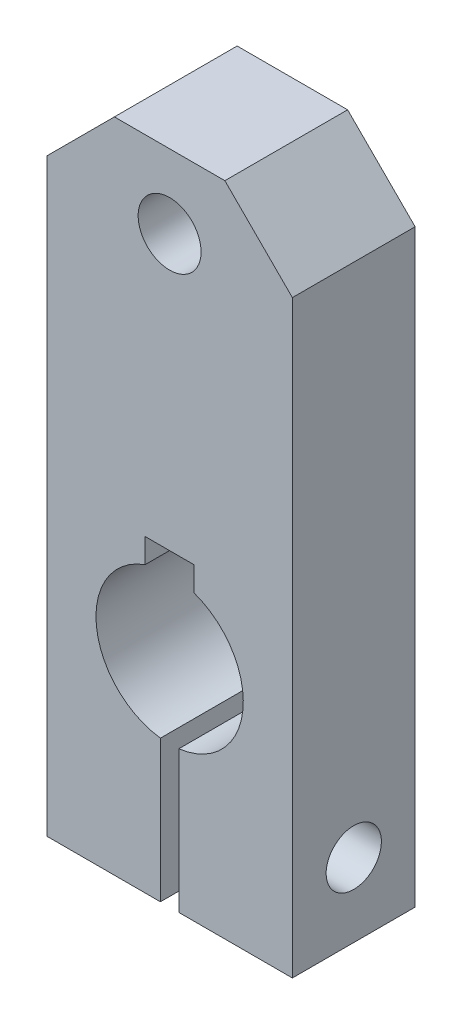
ISO-10303-21;
HEADER;
FILE_DESCRIPTION(('STEP AP214'),'2;1');
FILE_NAME('part.step','',(''),(''),'','','');
FILE_SCHEMA(('AUTOMOTIVE_DESIGN { 1 0 10303 214 1 1 1 1 }'));
ENDSEC;
DATA;
#1=APPLICATION_CONTEXT('core data for automotive mechanical design processes');
#2=APPLICATION_PROTOCOL_DEFINITION('international standard','automotive_design',2000,#1);
#3=PRODUCT_CONTEXT('',#1,'mechanical');
#4=PRODUCT('Part','Part','',(#3));
#5=PRODUCT_RELATED_PRODUCT_CATEGORY('part','',(#4));
#6=PRODUCT_DEFINITION_FORMATION('','',#4);
#7=PRODUCT_DEFINITION_CONTEXT('part definition',#1,'design');
#8=PRODUCT_DEFINITION('design','',#6,#7);
#9=PRODUCT_DEFINITION_SHAPE('','',#8);
#10=(LENGTH_UNIT() NAMED_UNIT(*) SI_UNIT(.MILLI.,.METRE.));
#11=(NAMED_UNIT(*) PLANE_ANGLE_UNIT() SI_UNIT($,.RADIAN.));
#12=(NAMED_UNIT(*) SI_UNIT($,.STERADIAN.) SOLID_ANGLE_UNIT());
#13=UNCERTAINTY_MEASURE_WITH_UNIT(LENGTH_MEASURE(1.E-05),#10,'distance_accuracy_value','');
#14=(GEOMETRIC_REPRESENTATION_CONTEXT(3) GLOBAL_UNCERTAINTY_ASSIGNED_CONTEXT((#13)) GLOBAL_UNIT_ASSIGNED_CONTEXT((#10,
#11,#12)) REPRESENTATION_CONTEXT('',''));
#15=CARTESIAN_POINT('',(0.,0.,0.));
#16=DIRECTION('',(0.,0.,1.));
#17=DIRECTION('',(1.,0.,0.));
#18=AXIS2_PLACEMENT_3D('',#15,#16,#17);
#19=CARTESIAN_POINT('',(0.,35.,10.));
#20=DIRECTION('',(0.,0.,1.));
#21=DIRECTION('',(1.,0.,0.));
#22=AXIS2_PLACEMENT_3D('',#19,#20,#21);
#23=PLANE('',#22);
#24=DIRECTION('',(1.,0.,0.));
#25=VECTOR('',#24,1.);
#26=CARTESIAN_POINT('',(1.5,0.,10.));
#27=LINE('',#26,#25);
#28=CARTESIAN_POINT('',(1.5,0.,10.));
#29=VERTEX_POINT('',#28);
#30=CARTESIAN_POINT('',(20.,0.,10.));
#31=VERTEX_POINT('',#30);
#32=EDGE_CURVE('E185',#29,#31,#27,.T.);
#33=ORIENTED_EDGE('',*,*,#32,.T.);
#34=DIRECTION('',(0.,1.,0.));
#35=VECTOR('',#34,1.);
#36=CARTESIAN_POINT('',(20.,96.,10.));
#37=LINE('',#36,#35);
#38=CARTESIAN_POINT('',(20.,96.,10.));
#39=VERTEX_POINT('',#38);
#40=EDGE_CURVE('E150',#31,#39,#37,.T.);
#41=ORIENTED_EDGE('',*,*,#40,.T.);
#42=DIRECTION('',(-0.707106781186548,0.707106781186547,0.));
#43=VECTOR('',#42,1.);
#44=CARTESIAN_POINT('',(8.99999999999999,107.,10.));
#45=LINE('',#44,#43);
#46=CARTESIAN_POINT('',(8.99999999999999,107.,10.));
#47=VERTEX_POINT('',#46);
#48=EDGE_CURVE('E188',#39,#47,#45,.T.);
#49=ORIENTED_EDGE('',*,*,#48,.T.);
#50=DIRECTION('',(-1.,0.,0.));
#51=VECTOR('',#50,1.);
#52=CARTESIAN_POINT('',(-9.00000000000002,107.,10.));
#53=LINE('',#52,#51);
#54=CARTESIAN_POINT('',(-9.00000000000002,107.,10.));
#55=VERTEX_POINT('',#54);
#56=EDGE_CURVE('E190',#47,#55,#53,.T.);
#57=ORIENTED_EDGE('',*,*,#56,.T.);
#58=DIRECTION('',(-0.707106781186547,-0.707106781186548,0.));
#59=VECTOR('',#58,1.);
#60=CARTESIAN_POINT('',(-20.,96.,10.));
#61=LINE('',#60,#59);
#62=CARTESIAN_POINT('',(-20.,96.,10.));
#63=VERTEX_POINT('',#62);
#64=EDGE_CURVE('E192',#55,#63,#61,.T.);
#65=ORIENTED_EDGE('',*,*,#64,.T.);
#66=DIRECTION('',(0.,-1.,0.));
#67=VECTOR('',#66,1.);
#68=CARTESIAN_POINT('',(-20.,96.,10.));
#69=LINE('',#68,#67);
#70=CARTESIAN_POINT('',(-20.,0.,10.));
#71=VERTEX_POINT('',#70);
#72=EDGE_CURVE('E194',#63,#71,#69,.T.);
#73=ORIENTED_EDGE('',*,*,#72,.T.);
#74=DIRECTION('',(1.,0.,0.));
#75=VECTOR('',#74,1.);
#76=CARTESIAN_POINT('',(-20.,0.,10.));
#77=LINE('',#76,#75);
#78=CARTESIAN_POINT('',(-1.5,0.,10.));
#79=VERTEX_POINT('',#78);
#80=EDGE_CURVE('E196',#71,#79,#77,.T.);
#81=ORIENTED_EDGE('',*,*,#80,.T.);
#82=DIRECTION('',(0.,1.,0.));
#83=VECTOR('',#82,1.);
#84=CARTESIAN_POINT('',(-1.5,23.0941191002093,10.));
#85=LINE('',#84,#83);
#86=CARTESIAN_POINT('',(-1.5,23.0941191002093,10.));
#87=VERTEX_POINT('',#86);
#88=EDGE_CURVE('E198',#79,#87,#85,.T.);
#89=ORIENTED_EDGE('',*,*,#88,.T.);
#90=CARTESIAN_POINT('',(0.,35.,10.));
#91=DIRECTION('',(0.,0.,-1.));
#92=DIRECTION('',(1.,0.,0.));
#93=AXIS2_PLACEMENT_3D('',#90,#91,#92);
#94=CIRCLE('',#93,12.);
#95=CARTESIAN_POINT('',(-4.,46.3137084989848,10.));
#96=VERTEX_POINT('',#95);
#97=EDGE_CURVE('E200',#87,#96,#94,.T.);
#98=ORIENTED_EDGE('',*,*,#97,.T.);
#99=DIRECTION('',(0.,1.,0.));
#100=VECTOR('',#99,1.);
#101=CARTESIAN_POINT('',(-4.,50.3,10.));
#102=LINE('',#101,#100);
#103=CARTESIAN_POINT('',(-4.,50.3,10.));
#104=VERTEX_POINT('',#103);
#105=EDGE_CURVE('E202',#96,#104,#102,.T.);
#106=ORIENTED_EDGE('',*,*,#105,.T.);
#107=DIRECTION('',(1.,0.,0.));
#108=VECTOR('',#107,1.);
#109=CARTESIAN_POINT('',(-4.,50.3,10.));
#110=LINE('',#109,#108);
#111=CARTESIAN_POINT('',(4.,50.3,10.));
#112=VERTEX_POINT('',#111);
#113=EDGE_CURVE('E204',#104,#112,#110,.T.);
#114=ORIENTED_EDGE('',*,*,#113,.T.);
#115=DIRECTION('',(0.,-1.,0.));
#116=VECTOR('',#115,1.);
#117=CARTESIAN_POINT('',(4.,50.3,10.));
#118=LINE('',#117,#116);
#119=CARTESIAN_POINT('',(4.,46.3137084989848,10.));
#120=VERTEX_POINT('',#119);
#121=EDGE_CURVE('E206',#112,#120,#118,.T.);
#122=ORIENTED_EDGE('',*,*,#121,.T.);
#123=CARTESIAN_POINT('',(0.,35.,10.));
#124=DIRECTION('',(0.,0.,-1.));
#125=DIRECTION('',(1.,0.,0.));
#126=AXIS2_PLACEMENT_3D('',#123,#124,#125);
#127=CIRCLE('',#126,12.);
#128=CARTESIAN_POINT('',(1.5,23.0941191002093,10.));
#129=VERTEX_POINT('',#128);
#130=EDGE_CURVE('E54',#120,#129,#127,.T.);
#131=ORIENTED_EDGE('',*,*,#130,.T.);
#132=DIRECTION('',(0.,-1.,0.));
#133=VECTOR('',#132,1.);
#134=CARTESIAN_POINT('',(1.5,23.0941191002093,10.));
#135=LINE('',#134,#133);
#136=EDGE_CURVE('E49',#129,#29,#135,.T.);
#137=ORIENTED_EDGE('',*,*,#136,.T.);
#138=EDGE_LOOP('',(#33,#41,#49,#57,#65,#73,#81,#89,#98,#106,#114,#122,#131,#137));
#139=FACE_BOUND('',#138,.T.);
#140=CARTESIAN_POINT('',(0.,95.,10.));
#141=DIRECTION('',(0.,0.,1.));
#142=DIRECTION('',(1.,0.,0.));
#143=AXIS2_PLACEMENT_3D('',#140,#141,#142);
#144=CIRCLE('',#143,5.125);
#145=CARTESIAN_POINT('',(5.125,95.,10.));
#146=VERTEX_POINT('',#145);
#147=EDGE_CURVE('E155',#146,#146,#144,.T.);
#148=ORIENTED_EDGE('',*,*,#147,.F.);
#149=EDGE_LOOP('',(#148));
#150=FACE_BOUND('',#149,.T.);
#151=ADVANCED_FACE('F34',(#139,#150),#23,.T.);
#152=CARTESIAN_POINT('',(0.,35.,-10.));
#153=DIRECTION('',(0.,0.,1.));
#154=DIRECTION('',(1.,0.,0.));
#155=AXIS2_PLACEMENT_3D('',#152,#153,#154);
#156=PLANE('',#155);
#157=DIRECTION('',(1.,0.,0.));
#158=VECTOR('',#157,1.);
#159=CARTESIAN_POINT('',(1.5,0.,-10.));
#160=LINE('',#159,#158);
#161=CARTESIAN_POINT('',(1.5,0.,-10.));
#162=VERTEX_POINT('',#161);
#163=CARTESIAN_POINT('',(20.,0.,-10.));
#164=VERTEX_POINT('',#163);
#165=EDGE_CURVE('E141',#162,#164,#160,.T.);
#166=ORIENTED_EDGE('',*,*,#165,.F.);
#167=DIRECTION('',(0.,-1.,0.));
#168=VECTOR('',#167,1.);
#169=CARTESIAN_POINT('',(1.5,23.0941191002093,-10.));
#170=LINE('',#169,#168);
#171=CARTESIAN_POINT('',(1.5,23.0941191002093,-10.));
#172=VERTEX_POINT('',#171);
#173=EDGE_CURVE('E183',#172,#162,#170,.T.);
#174=ORIENTED_EDGE('',*,*,#173,.F.);
#175=CARTESIAN_POINT('',(0.,35.,-10.));
#176=DIRECTION('',(0.,0.,-1.));
#177=DIRECTION('',(1.,0.,0.));
#178=AXIS2_PLACEMENT_3D('',#175,#176,#177);
#179=CIRCLE('',#178,12.);
#180=CARTESIAN_POINT('',(4.,46.3137084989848,-10.));
#181=VERTEX_POINT('',#180);
#182=EDGE_CURVE('E181',#181,#172,#179,.T.);
#183=ORIENTED_EDGE('',*,*,#182,.F.);
#184=DIRECTION('',(0.,-1.,0.));
#185=VECTOR('',#184,1.);
#186=CARTESIAN_POINT('',(4.,50.3,-10.));
#187=LINE('',#186,#185);
#188=CARTESIAN_POINT('',(4.,50.3,-10.));
#189=VERTEX_POINT('',#188);
#190=EDGE_CURVE('E179',#189,#181,#187,.T.);
#191=ORIENTED_EDGE('',*,*,#190,.F.);
#192=DIRECTION('',(1.,0.,0.));
#193=VECTOR('',#192,1.);
#194=CARTESIAN_POINT('',(-4.,50.3,-10.));
#195=LINE('',#194,#193);
#196=CARTESIAN_POINT('',(-4.,50.3,-10.));
#197=VERTEX_POINT('',#196);
#198=EDGE_CURVE('E177',#197,#189,#195,.T.);
#199=ORIENTED_EDGE('',*,*,#198,.F.);
#200=DIRECTION('',(0.,1.,0.));
#201=VECTOR('',#200,1.);
#202=CARTESIAN_POINT('',(-4.,50.3,-10.));
#203=LINE('',#202,#201);
#204=CARTESIAN_POINT('',(-4.,46.3137084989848,-10.));
#205=VERTEX_POINT('',#204);
#206=EDGE_CURVE('E175',#205,#197,#203,.T.);
#207=ORIENTED_EDGE('',*,*,#206,.F.);
#208=CARTESIAN_POINT('',(0.,35.,-10.));
#209=DIRECTION('',(0.,0.,-1.));
#210=DIRECTION('',(1.,0.,0.));
#211=AXIS2_PLACEMENT_3D('',#208,#209,#210);
#212=CIRCLE('',#211,12.);
#213=CARTESIAN_POINT('',(-1.5,23.0941191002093,-10.));
#214=VERTEX_POINT('',#213);
#215=EDGE_CURVE('E173',#214,#205,#212,.T.);
#216=ORIENTED_EDGE('',*,*,#215,.F.);
#217=DIRECTION('',(0.,1.,0.));
#218=VECTOR('',#217,1.);
#219=CARTESIAN_POINT('',(-1.5,23.0941191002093,-10.));
#220=LINE('',#219,#218);
#221=CARTESIAN_POINT('',(-1.5,0.,-10.));
#222=VERTEX_POINT('',#221);
#223=EDGE_CURVE('E171',#222,#214,#220,.T.);
#224=ORIENTED_EDGE('',*,*,#223,.F.);
#225=DIRECTION('',(1.,0.,0.));
#226=VECTOR('',#225,1.);
#227=CARTESIAN_POINT('',(-20.,0.,-10.));
#228=LINE('',#227,#226);
#229=CARTESIAN_POINT('',(-20.,0.,-10.));
#230=VERTEX_POINT('',#229);
#231=EDGE_CURVE('E169',#230,#222,#228,.T.);
#232=ORIENTED_EDGE('',*,*,#231,.F.);
#233=DIRECTION('',(0.,-1.,0.));
#234=VECTOR('',#233,1.);
#235=CARTESIAN_POINT('',(-20.,96.,-10.));
#236=LINE('',#235,#234);
#237=CARTESIAN_POINT('',(-20.,96.,-10.));
#238=VERTEX_POINT('',#237);
#239=EDGE_CURVE('E167',#238,#230,#236,.T.);
#240=ORIENTED_EDGE('',*,*,#239,.F.);
#241=DIRECTION('',(-0.707106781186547,-0.707106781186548,0.));
#242=VECTOR('',#241,1.);
#243=CARTESIAN_POINT('',(-20.,96.,-10.));
#244=LINE('',#243,#242);
#245=CARTESIAN_POINT('',(-9.00000000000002,107.,-10.));
#246=VERTEX_POINT('',#245);
#247=EDGE_CURVE('E165',#246,#238,#244,.T.);
#248=ORIENTED_EDGE('',*,*,#247,.F.);
#249=DIRECTION('',(-1.,0.,0.));
#250=VECTOR('',#249,1.);
#251=CARTESIAN_POINT('',(-9.00000000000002,107.,-10.));
#252=LINE('',#251,#250);
#253=CARTESIAN_POINT('',(8.99999999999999,107.,-10.));
#254=VERTEX_POINT('',#253);
#255=EDGE_CURVE('E163',#254,#246,#252,.T.);
#256=ORIENTED_EDGE('',*,*,#255,.F.);
#257=DIRECTION('',(-0.707106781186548,0.707106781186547,0.));
#258=VECTOR('',#257,1.);
#259=CARTESIAN_POINT('',(8.99999999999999,107.,-10.));
#260=LINE('',#259,#258);
#261=CARTESIAN_POINT('',(20.,96.,-10.));
#262=VERTEX_POINT('',#261);
#263=EDGE_CURVE('E143',#262,#254,#260,.T.);
#264=ORIENTED_EDGE('',*,*,#263,.F.);
#265=DIRECTION('',(0.,1.,0.));
#266=VECTOR('',#265,1.);
#267=CARTESIAN_POINT('',(20.,96.,-10.));
#268=LINE('',#267,#266);
#269=EDGE_CURVE('E136',#164,#262,#268,.T.);
#270=ORIENTED_EDGE('',*,*,#269,.F.);
#271=EDGE_LOOP('',(#166,#174,#183,#191,#199,#207,#216,#224,#232,#240,#248,#256,#264,#270));
#272=FACE_BOUND('',#271,.T.);
#273=CARTESIAN_POINT('',(0.,95.,-10.));
#274=DIRECTION('',(0.,0.,1.));
#275=DIRECTION('',(1.,0.,0.));
#276=AXIS2_PLACEMENT_3D('',#273,#274,#275);
#277=CIRCLE('',#276,5.125);
#278=CARTESIAN_POINT('',(5.125,95.,-10.));
#279=VERTEX_POINT('',#278);
#280=EDGE_CURVE('E158',#279,#279,#277,.T.);
#281=ORIENTED_EDGE('',*,*,#280,.T.);
#282=EDGE_LOOP('',(#281));
#283=FACE_BOUND('',#282,.T.);
#284=ADVANCED_FACE('F137',(#272,#283),#156,.F.);
#285=CARTESIAN_POINT('',(1.5,0.,10.));
#286=DIRECTION('',(0.,1.,0.));
#287=DIRECTION('',(0.,0.,1.));
#288=AXIS2_PLACEMENT_3D('',#285,#286,#287);
#289=PLANE('',#288);
#290=ORIENTED_EDGE('',*,*,#165,.T.);
#291=DIRECTION('',(0.,0.,-1.));
#292=VECTOR('',#291,1.);
#293=CARTESIAN_POINT('',(20.,0.,10.));
#294=LINE('',#293,#292);
#295=EDGE_CURVE('E11',#31,#164,#294,.T.);
#296=ORIENTED_EDGE('',*,*,#295,.F.);
#297=ORIENTED_EDGE('',*,*,#32,.F.);
#298=DIRECTION('',(0.,0.,-1.));
#299=VECTOR('',#298,1.);
#300=CARTESIAN_POINT('',(1.5,0.,10.));
#301=LINE('',#300,#299);
#302=EDGE_CURVE('E154',#29,#162,#301,.T.);
#303=ORIENTED_EDGE('',*,*,#302,.T.);
#304=EDGE_LOOP('',(#290,#296,#297,#303));
#305=FACE_BOUND('',#304,.T.);
#306=ADVANCED_FACE('F36',(#305),#289,.F.);
#307=CARTESIAN_POINT('',(20.,96.,10.));
#308=DIRECTION('',(-1.,0.,0.));
#309=DIRECTION('',(0.,-1.,0.));
#310=AXIS2_PLACEMENT_3D('',#307,#308,#309);
#311=PLANE('',#310);
#312=CARTESIAN_POINT('',(20.,12.,0.));
#313=DIRECTION('',(1.,0.,0.));
#314=DIRECTION('',(0.,1.,0.));
#315=AXIS2_PLACEMENT_3D('',#312,#313,#314);
#316=CIRCLE('',#315,4.5);
#317=CARTESIAN_POINT('',(20.,16.5,0.));
#318=VERTEX_POINT('',#317);
#319=EDGE_CURVE('E339',#318,#318,#316,.T.);
#320=ORIENTED_EDGE('',*,*,#319,.F.);
#321=EDGE_LOOP('',(#320));
#322=FACE_BOUND('',#321,.T.);
#323=ORIENTED_EDGE('',*,*,#269,.T.);
#324=DIRECTION('',(0.,0.,-1.));
#325=VECTOR('',#324,1.);
#326=CARTESIAN_POINT('',(20.,96.,10.));
#327=LINE('',#326,#325);
#328=EDGE_CURVE('E42',#39,#262,#327,.T.);
#329=ORIENTED_EDGE('',*,*,#328,.F.);
#330=ORIENTED_EDGE('',*,*,#40,.F.);
#331=ORIENTED_EDGE('',*,*,#295,.T.);
#332=EDGE_LOOP('',(#323,#329,#330,#331));
#333=FACE_BOUND('',#332,.T.);
#334=ADVANCED_FACE('F149',(#322,#333),#311,.F.);
#335=CARTESIAN_POINT('',(8.99999999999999,107.,10.));
#336=DIRECTION('',(-0.707106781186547,-0.707106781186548,0.));
#337=DIRECTION('',(0.707106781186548,-0.707106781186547,0.));
#338=AXIS2_PLACEMENT_3D('',#335,#336,#337);
#339=PLANE('',#338);
#340=ORIENTED_EDGE('',*,*,#263,.T.);
#341=DIRECTION('',(0.,0.,-1.));
#342=VECTOR('',#341,1.);
#343=CARTESIAN_POINT('',(8.99999999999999,107.,10.));
#344=LINE('',#343,#342);
#345=EDGE_CURVE('E241',#47,#254,#344,.T.);
#346=ORIENTED_EDGE('',*,*,#345,.F.);
#347=ORIENTED_EDGE('',*,*,#48,.F.);
#348=ORIENTED_EDGE('',*,*,#328,.T.);
#349=EDGE_LOOP('',(#340,#346,#347,#348));
#350=FACE_BOUND('',#349,.T.);
#351=ADVANCED_FACE('F245',(#350),#339,.F.);
#352=CARTESIAN_POINT('',(-9.00000000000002,107.,10.));
#353=DIRECTION('',(0.,-1.,0.));
#354=DIRECTION('',(1.,0.,0.));
#355=AXIS2_PLACEMENT_3D('',#352,#353,#354);
#356=PLANE('',#355);
#357=ORIENTED_EDGE('',*,*,#255,.T.);
#358=DIRECTION('',(0.,0.,-1.));
#359=VECTOR('',#358,1.);
#360=CARTESIAN_POINT('',(-9.00000000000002,107.,10.));
#361=LINE('',#360,#359);
#362=EDGE_CURVE('E238',#55,#246,#361,.T.);
#363=ORIENTED_EDGE('',*,*,#362,.F.);
#364=ORIENTED_EDGE('',*,*,#56,.F.);
#365=ORIENTED_EDGE('',*,*,#345,.T.);
#366=EDGE_LOOP('',(#357,#363,#364,#365));
#367=FACE_BOUND('',#366,.T.);
#368=ADVANCED_FACE('F253',(#367),#356,.F.);
#369=CARTESIAN_POINT('',(-20.,96.,10.));
#370=DIRECTION('',(0.707106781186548,-0.707106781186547,0.));
#371=DIRECTION('',(0.707106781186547,0.707106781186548,0.));
#372=AXIS2_PLACEMENT_3D('',#369,#370,#371);
#373=PLANE('',#372);
#374=ORIENTED_EDGE('',*,*,#247,.T.);
#375=DIRECTION('',(0.,0.,-1.));
#376=VECTOR('',#375,1.);
#377=CARTESIAN_POINT('',(-20.,96.,10.));
#378=LINE('',#377,#376);
#379=EDGE_CURVE('E235',#63,#238,#378,.T.);
#380=ORIENTED_EDGE('',*,*,#379,.F.);
#381=ORIENTED_EDGE('',*,*,#64,.F.);
#382=ORIENTED_EDGE('',*,*,#362,.T.);
#383=EDGE_LOOP('',(#374,#380,#381,#382));
#384=FACE_BOUND('',#383,.T.);
#385=ADVANCED_FACE('F256',(#384),#373,.F.);
#386=CARTESIAN_POINT('',(-20.,96.,10.));
#387=DIRECTION('',(1.,0.,0.));
#388=DIRECTION('',(0.,1.,0.));
#389=AXIS2_PLACEMENT_3D('',#386,#387,#388);
#390=PLANE('',#389);
#391=CARTESIAN_POINT('',(-20.,12.,0.));
#392=DIRECTION('',(1.,0.,0.));
#393=DIRECTION('',(0.,1.,0.));
#394=AXIS2_PLACEMENT_3D('',#391,#392,#393);
#395=CIRCLE('',#394,3.375);
#396=CARTESIAN_POINT('',(-20.,15.375,0.));
#397=VERTEX_POINT('',#396);
#398=EDGE_CURVE('E328',#397,#397,#395,.T.);
#399=ORIENTED_EDGE('',*,*,#398,.T.);
#400=EDGE_LOOP('',(#399));
#401=FACE_BOUND('',#400,.T.);
#402=ORIENTED_EDGE('',*,*,#239,.T.);
#403=DIRECTION('',(0.,0.,-1.));
#404=VECTOR('',#403,1.);
#405=CARTESIAN_POINT('',(-20.,0.,10.));
#406=LINE('',#405,#404);
#407=EDGE_CURVE('E232',#71,#230,#406,.T.);
#408=ORIENTED_EDGE('',*,*,#407,.F.);
#409=ORIENTED_EDGE('',*,*,#72,.F.);
#410=ORIENTED_EDGE('',*,*,#379,.T.);
#411=EDGE_LOOP('',(#402,#408,#409,#410));
#412=FACE_BOUND('',#411,.T.);
#413=ADVANCED_FACE('F261',(#401,#412),#390,.F.);
#414=CARTESIAN_POINT('',(-20.,0.,10.));
#415=DIRECTION('',(0.,1.,0.));
#416=DIRECTION('',(0.,0.,1.));
#417=AXIS2_PLACEMENT_3D('',#414,#415,#416);
#418=PLANE('',#417);
#419=ORIENTED_EDGE('',*,*,#231,.T.);
#420=DIRECTION('',(0.,0.,-1.));
#421=VECTOR('',#420,1.);
#422=CARTESIAN_POINT('',(-1.5,0.,10.));
#423=LINE('',#422,#421);
#424=EDGE_CURVE('E229',#79,#222,#423,.T.);
#425=ORIENTED_EDGE('',*,*,#424,.F.);
#426=ORIENTED_EDGE('',*,*,#80,.F.);
#427=ORIENTED_EDGE('',*,*,#407,.T.);
#428=EDGE_LOOP('',(#419,#425,#426,#427));
#429=FACE_BOUND('',#428,.T.);
#430=ADVANCED_FACE('F267',(#429),#418,.F.);
#431=CARTESIAN_POINT('',(-1.5,23.0941191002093,10.));
#432=DIRECTION('',(-1.,0.,0.));
#433=DIRECTION('',(0.,-1.,0.));
#434=AXIS2_PLACEMENT_3D('',#431,#432,#433);
#435=PLANE('',#434);
#436=CARTESIAN_POINT('',(-1.5,12.,0.));
#437=DIRECTION('',(1.,0.,0.));
#438=DIRECTION('',(0.,1.,0.));
#439=AXIS2_PLACEMENT_3D('',#436,#437,#438);
#440=CIRCLE('',#439,3.375);
#441=CARTESIAN_POINT('',(-1.5,15.375,0.));
#442=VERTEX_POINT('',#441);
#443=EDGE_CURVE('E331',#442,#442,#440,.T.);
#444=ORIENTED_EDGE('',*,*,#443,.F.);
#445=EDGE_LOOP('',(#444));
#446=FACE_BOUND('',#445,.T.);
#447=ORIENTED_EDGE('',*,*,#223,.T.);
#448=DIRECTION('',(0.,0.,-1.));
#449=VECTOR('',#448,1.);
#450=CARTESIAN_POINT('',(-1.5,23.0941191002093,10.));
#451=LINE('',#450,#449);
#452=EDGE_CURVE('E226',#87,#214,#451,.T.);
#453=ORIENTED_EDGE('',*,*,#452,.F.);
#454=ORIENTED_EDGE('',*,*,#88,.F.);
#455=ORIENTED_EDGE('',*,*,#424,.T.);
#456=EDGE_LOOP('',(#447,#453,#454,#455));
#457=FACE_BOUND('',#456,.T.);
#458=ADVANCED_FACE('F271',(#446,#457),#435,.F.);
#459=CARTESIAN_POINT('',(0.,35.,10.));
#460=DIRECTION('',(0.,0.,-1.));
#461=DIRECTION('',(-1.,0.,0.));
#462=AXIS2_PLACEMENT_3D('',#459,#460,#461);
#463=CYLINDRICAL_SURFACE('',#462,12.);
#464=ORIENTED_EDGE('',*,*,#215,.T.);
#465=DIRECTION('',(0.,0.,-1.));
#466=VECTOR('',#465,1.);
#467=CARTESIAN_POINT('',(-4.,46.3137084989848,10.));
#468=LINE('',#467,#466);
#469=EDGE_CURVE('E223',#96,#205,#468,.T.);
#470=ORIENTED_EDGE('',*,*,#469,.F.);
#471=ORIENTED_EDGE('',*,*,#97,.F.);
#472=ORIENTED_EDGE('',*,*,#452,.T.);
#473=EDGE_LOOP('',(#464,#470,#471,#472));
#474=FACE_BOUND('',#473,.T.);
#475=ADVANCED_FACE('F276',(#474),#463,.F.);
#476=CARTESIAN_POINT('',(-4.,50.3,10.));
#477=DIRECTION('',(-1.,0.,0.));
#478=DIRECTION('',(0.,-1.,0.));
#479=AXIS2_PLACEMENT_3D('',#476,#477,#478);
#480=PLANE('',#479);
#481=ORIENTED_EDGE('',*,*,#206,.T.);
#482=DIRECTION('',(0.,0.,-1.));
#483=VECTOR('',#482,1.);
#484=CARTESIAN_POINT('',(-4.,50.3,10.));
#485=LINE('',#484,#483);
#486=EDGE_CURVE('E220',#104,#197,#485,.T.);
#487=ORIENTED_EDGE('',*,*,#486,.F.);
#488=ORIENTED_EDGE('',*,*,#105,.F.);
#489=ORIENTED_EDGE('',*,*,#469,.T.);
#490=EDGE_LOOP('',(#481,#487,#488,#489));
#491=FACE_BOUND('',#490,.T.);
#492=ADVANCED_FACE('F282',(#491),#480,.F.);
#493=CARTESIAN_POINT('',(-4.,50.3,10.));
#494=DIRECTION('',(0.,1.,0.));
#495=DIRECTION('',(0.,0.,1.));
#496=AXIS2_PLACEMENT_3D('',#493,#494,#495);
#497=PLANE('',#496);
#498=ORIENTED_EDGE('',*,*,#198,.T.);
#499=DIRECTION('',(0.,0.,-1.));
#500=VECTOR('',#499,1.);
#501=CARTESIAN_POINT('',(4.,50.3,10.));
#502=LINE('',#501,#500);
#503=EDGE_CURVE('E217',#112,#189,#502,.T.);
#504=ORIENTED_EDGE('',*,*,#503,.F.);
#505=ORIENTED_EDGE('',*,*,#113,.F.);
#506=ORIENTED_EDGE('',*,*,#486,.T.);
#507=EDGE_LOOP('',(#498,#504,#505,#506));
#508=FACE_BOUND('',#507,.T.);
#509=ADVANCED_FACE('F286',(#508),#497,.F.);
#510=CARTESIAN_POINT('',(4.,50.3,10.));
#511=DIRECTION('',(1.,0.,0.));
#512=DIRECTION('',(0.,1.,0.));
#513=AXIS2_PLACEMENT_3D('',#510,#511,#512);
#514=PLANE('',#513);
#515=ORIENTED_EDGE('',*,*,#190,.T.);
#516=DIRECTION('',(0.,0.,-1.));
#517=VECTOR('',#516,1.);
#518=CARTESIAN_POINT('',(4.,46.3137084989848,10.));
#519=LINE('',#518,#517);
#520=EDGE_CURVE('E214',#120,#181,#519,.T.);
#521=ORIENTED_EDGE('',*,*,#520,.F.);
#522=ORIENTED_EDGE('',*,*,#121,.F.);
#523=ORIENTED_EDGE('',*,*,#503,.T.);
#524=EDGE_LOOP('',(#515,#521,#522,#523));
#525=FACE_BOUND('',#524,.T.);
#526=ADVANCED_FACE('F291',(#525),#514,.F.);
#527=CARTESIAN_POINT('',(0.,35.,10.));
#528=DIRECTION('',(0.,0.,-1.));
#529=DIRECTION('',(-1.,0.,0.));
#530=AXIS2_PLACEMENT_3D('',#527,#528,#529);
#531=CYLINDRICAL_SURFACE('',#530,12.);
#532=ORIENTED_EDGE('',*,*,#182,.T.);
#533=DIRECTION('',(0.,0.,-1.));
#534=VECTOR('',#533,1.);
#535=CARTESIAN_POINT('',(1.5,23.0941191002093,10.));
#536=LINE('',#535,#534);
#537=EDGE_CURVE('E211',#129,#172,#536,.T.);
#538=ORIENTED_EDGE('',*,*,#537,.F.);
#539=ORIENTED_EDGE('',*,*,#130,.F.);
#540=ORIENTED_EDGE('',*,*,#520,.T.);
#541=EDGE_LOOP('',(#532,#538,#539,#540));
#542=FACE_BOUND('',#541,.T.);
#543=ADVANCED_FACE('F294',(#542),#531,.F.);
#544=CARTESIAN_POINT('',(1.5,23.0941191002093,10.));
#545=DIRECTION('',(1.,0.,0.));
#546=DIRECTION('',(0.,1.,0.));
#547=AXIS2_PLACEMENT_3D('',#544,#545,#546);
#548=PLANE('',#547);
#549=CARTESIAN_POINT('',(1.5,12.,0.));
#550=DIRECTION('',(1.,0.,0.));
#551=DIRECTION('',(0.,1.,0.));
#552=AXIS2_PLACEMENT_3D('',#549,#550,#551);
#553=CIRCLE('',#552,4.5);
#554=CARTESIAN_POINT('',(1.5,16.5,0.));
#555=VERTEX_POINT('',#554);
#556=EDGE_CURVE('E334',#555,#555,#553,.F.);
#557=ORIENTED_EDGE('',*,*,#556,.F.);
#558=EDGE_LOOP('',(#557));
#559=FACE_BOUND('',#558,.T.);
#560=ORIENTED_EDGE('',*,*,#173,.T.);
#561=ORIENTED_EDGE('',*,*,#302,.F.);
#562=ORIENTED_EDGE('',*,*,#136,.F.);
#563=ORIENTED_EDGE('',*,*,#537,.T.);
#564=EDGE_LOOP('',(#560,#561,#562,#563));
#565=FACE_BOUND('',#564,.T.);
#566=ADVANCED_FACE('F296',(#559,#565),#548,.F.);
#567=CARTESIAN_POINT('',(0.,95.,10.));
#568=DIRECTION('',(0.,0.,-1.));
#569=DIRECTION('',(-1.,0.,0.));
#570=AXIS2_PLACEMENT_3D('',#567,#568,#569);
#571=CYLINDRICAL_SURFACE('',#570,5.125);
#572=ORIENTED_EDGE('',*,*,#147,.T.);
#573=EDGE_LOOP('',(#572));
#574=FACE_BOUND('',#573,.T.);
#575=ORIENTED_EDGE('',*,*,#280,.F.);
#576=EDGE_LOOP('',(#575));
#577=FACE_BOUND('',#576,.T.);
#578=ADVANCED_FACE('F298',(#574,#577),#571,.F.);
#579=CARTESIAN_POINT('',(-20.001,12.,0.));
#580=DIRECTION('',(1.,0.,0.));
#581=DIRECTION('',(0.,1.,0.));
#582=AXIS2_PLACEMENT_3D('',#579,#580,#581);
#583=CYLINDRICAL_SURFACE('',#582,4.5);
#584=ORIENTED_EDGE('',*,*,#319,.T.);
#585=EDGE_LOOP('',(#584));
#586=FACE_BOUND('',#585,.T.);
#587=ORIENTED_EDGE('',*,*,#556,.T.);
#588=EDGE_LOOP('',(#587));
#589=FACE_BOUND('',#588,.T.);
#590=ADVANCED_FACE('F305',(#586,#589),#583,.F.);
#591=CARTESIAN_POINT('',(-20.,12.,0.));
#592=DIRECTION('',(1.,0.,0.));
#593=DIRECTION('',(0.,1.,0.));
#594=AXIS2_PLACEMENT_3D('',#591,#592,#593);
#595=CYLINDRICAL_SURFACE('',#594,3.375);
#596=ORIENTED_EDGE('',*,*,#398,.F.);
#597=EDGE_LOOP('',(#596));
#598=FACE_BOUND('',#597,.T.);
#599=ORIENTED_EDGE('',*,*,#443,.T.);
#600=EDGE_LOOP('',(#599));
#601=FACE_BOUND('',#600,.T.);
#602=ADVANCED_FACE('F319',(#598,#601),#595,.F.);
#603=CLOSED_SHELL('',(#151,#284,#306,#334,#351,#368,#385,#413,#430,#458,#475,#492,#509,#526,
#543,#566,#578,#590,#602));
#604=MANIFOLD_SOLID_BREP('B2',#603);
#605=ADVANCED_BREP_SHAPE_REPRESENTATION('',(#18,#604),#14);
#606=SHAPE_DEFINITION_REPRESENTATION(#9,#605);
ENDSEC;
END-ISO-10303-21;
